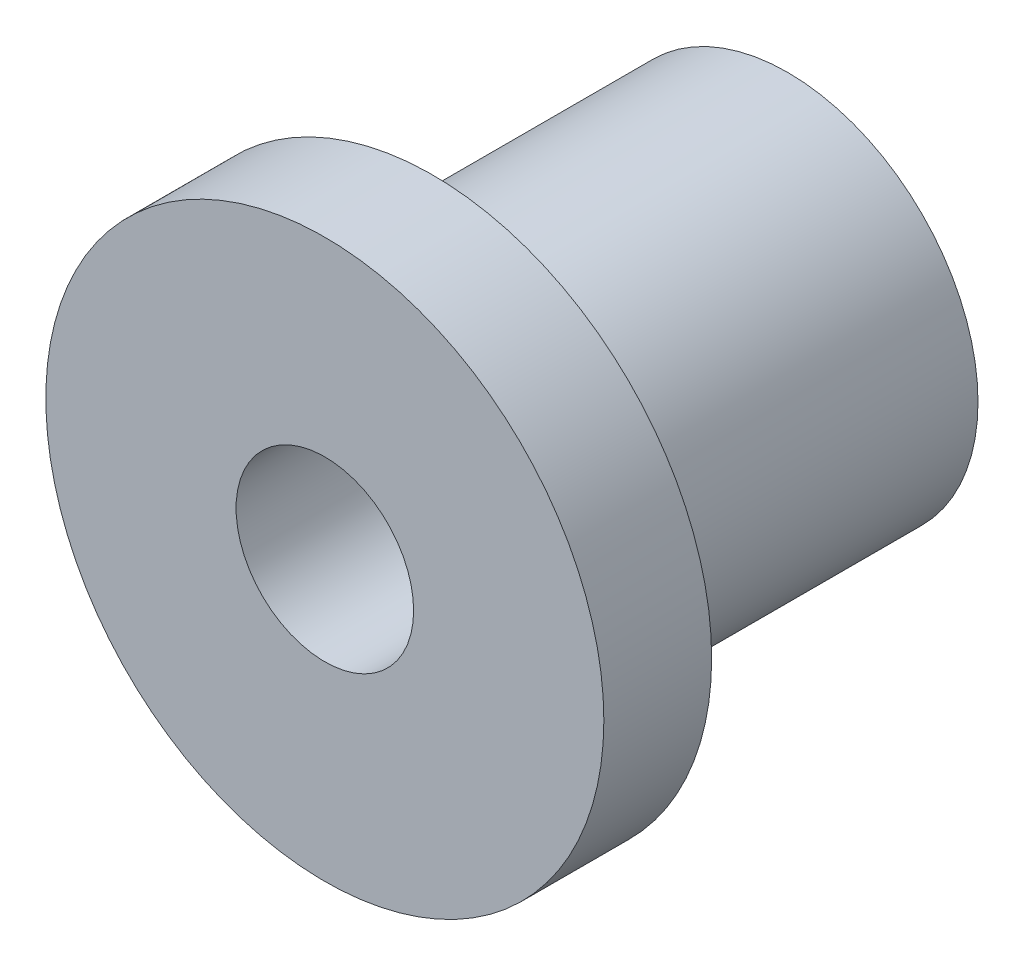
from build123d import *

# Parameters (mm, degrees)
SKETCH1_R           = 3.81
BASE_EXTRUDE_DEPTH  = 7.112
SKETCH5_R           = 5.588
BOSS_EXTRUDE4_DEPTH = 2.159
SKETCH6_R           = 1.778
CUT_EXTRUDE1_DEPTH  = 2.794


with BuildPart() as part:
    # Sketch1 → Base-Extrude (new body)
    with BuildSketch(Plane.XY):
        Circle(SKETCH1_R)
    extrude(amount=BASE_EXTRUDE_DEPTH)

    # Sketch5 → Boss-Extrude4 (add)
    with BuildSketch(Plane.XY.offset(7.112)):
        Circle(SKETCH5_R)
    extrude(amount=BOSS_EXTRUDE4_DEPTH)

    # Sketch6 → Cut-Extrude1 (cut)
    with BuildSketch(Plane.XY.offset(9.271)):
        Circle(SKETCH6_R)
    extrude(amount=-CUT_EXTRUDE1_DEPTH, mode=Mode.SUBTRACT)


solid = part.part
